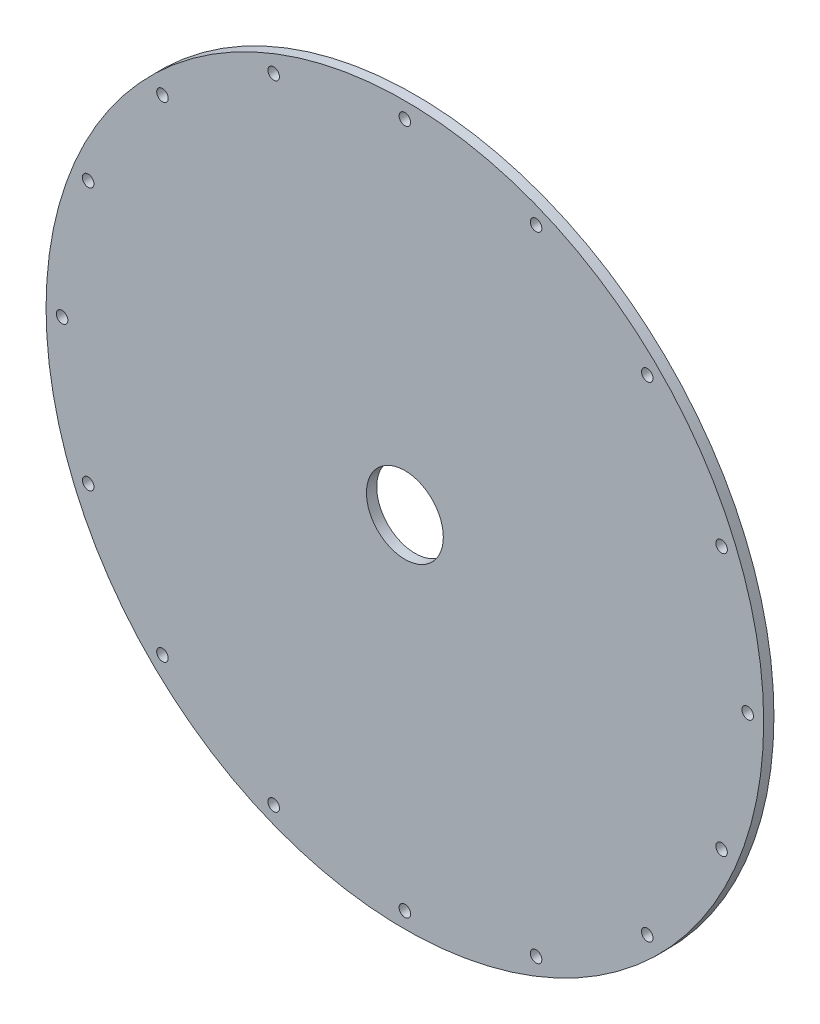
ISO-10303-21;
HEADER;
FILE_DESCRIPTION(('STEP AP214'),'2;1');
FILE_NAME('part.step','',(''),(''),'','','');
FILE_SCHEMA(('AUTOMOTIVE_DESIGN { 1 0 10303 214 1 1 1 1 }'));
ENDSEC;
DATA;
#1=APPLICATION_CONTEXT('core data for automotive mechanical design processes');
#2=APPLICATION_PROTOCOL_DEFINITION('international standard','automotive_design',2000,#1);
#3=PRODUCT_CONTEXT('',#1,'mechanical');
#4=PRODUCT('Part','Part','',(#3));
#5=PRODUCT_RELATED_PRODUCT_CATEGORY('part','',(#4));
#6=PRODUCT_DEFINITION_FORMATION('','',#4);
#7=PRODUCT_DEFINITION_CONTEXT('part definition',#1,'design');
#8=PRODUCT_DEFINITION('design','',#6,#7);
#9=PRODUCT_DEFINITION_SHAPE('','',#8);
#10=(LENGTH_UNIT() NAMED_UNIT(*) SI_UNIT(.MILLI.,.METRE.));
#11=(NAMED_UNIT(*) PLANE_ANGLE_UNIT() SI_UNIT($,.RADIAN.));
#12=(NAMED_UNIT(*) SI_UNIT($,.STERADIAN.) SOLID_ANGLE_UNIT());
#13=UNCERTAINTY_MEASURE_WITH_UNIT(LENGTH_MEASURE(1.E-05),#10,'distance_accuracy_value','');
#14=(GEOMETRIC_REPRESENTATION_CONTEXT(3) GLOBAL_UNCERTAINTY_ASSIGNED_CONTEXT((#13)) GLOBAL_UNIT_ASSIGNED_CONTEXT((#10,
#11,#12)) REPRESENTATION_CONTEXT('',''));
#15=CARTESIAN_POINT('',(0.,0.,0.));
#16=DIRECTION('',(0.,0.,1.));
#17=DIRECTION('',(1.,0.,0.));
#18=AXIS2_PLACEMENT_3D('',#15,#16,#17);
#19=CARTESIAN_POINT('',(0.,0.,8.));
#20=DIRECTION('',(0.,0.,1.));
#21=DIRECTION('',(1.,0.,0.));
#22=AXIS2_PLACEMENT_3D('',#19,#20,#21);
#23=PLANE('',#22);
#24=CARTESIAN_POINT('',(102.367818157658,247.137774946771,8.));
#25=DIRECTION('',(0.,0.,1.));
#26=DIRECTION('',(1.,0.,0.));
#27=AXIS2_PLACEMENT_3D('',#24,#25,#26);
#28=CIRCLE('',#27,4.50000000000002);
#29=CARTESIAN_POINT('',(106.867818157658,247.137774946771,8.));
#30=VERTEX_POINT('',#29);
#31=EDGE_CURVE('E140',#30,#30,#28,.T.);
#32=ORIENTED_EDGE('',*,*,#31,.F.);
#33=EDGE_LOOP('',(#32));
#34=FACE_BOUND('',#33,.T.);
#35=CARTESIAN_POINT('',(189.151063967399,189.151063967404,8.));
#36=DIRECTION('',(0.,0.,1.));
#37=DIRECTION('',(1.,0.,0.));
#38=AXIS2_PLACEMENT_3D('',#35,#36,#37);
#39=CIRCLE('',#38,4.5);
#40=CARTESIAN_POINT('',(193.651063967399,189.151063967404,8.));
#41=VERTEX_POINT('',#40);
#42=EDGE_CURVE('E134',#41,#41,#39,.T.);
#43=ORIENTED_EDGE('',*,*,#42,.F.);
#44=EDGE_LOOP('',(#43));
#45=FACE_BOUND('',#44,.T.);
#46=CARTESIAN_POINT('',(247.137774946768,102.367818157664,8.));
#47=DIRECTION('',(0.,0.,1.));
#48=DIRECTION('',(1.,0.,0.));
#49=AXIS2_PLACEMENT_3D('',#46,#47,#48);
#50=CIRCLE('',#49,4.50000000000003);
#51=CARTESIAN_POINT('',(251.637774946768,102.367818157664,8.));
#52=VERTEX_POINT('',#51);
#53=EDGE_CURVE('E128',#52,#52,#50,.T.);
#54=ORIENTED_EDGE('',*,*,#53,.F.);
#55=EDGE_LOOP('',(#54));
#56=FACE_BOUND('',#55,.T.);
#57=CARTESIAN_POINT('',(267.5,2.80191539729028E-12,8.));
#58=DIRECTION('',(0.,0.,1.));
#59=DIRECTION('',(1.,0.,0.));
#60=AXIS2_PLACEMENT_3D('',#57,#58,#59);
#61=CIRCLE('',#60,4.5);
#62=CARTESIAN_POINT('',(272.,2.80191539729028E-12,8.));
#63=VERTEX_POINT('',#62);
#64=EDGE_CURVE('E122',#63,#63,#61,.T.);
#65=ORIENTED_EDGE('',*,*,#64,.F.);
#66=EDGE_LOOP('',(#65));
#67=FACE_BOUND('',#66,.T.);
#68=CARTESIAN_POINT('',(247.13777494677,-102.367818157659,8.));
#69=DIRECTION('',(0.,0.,1.));
#70=DIRECTION('',(1.,0.,0.));
#71=AXIS2_PLACEMENT_3D('',#68,#69,#70);
#72=CIRCLE('',#71,4.5);
#73=CARTESIAN_POINT('',(251.63777494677,-102.367818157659,8.));
#74=VERTEX_POINT('',#73);
#75=EDGE_CURVE('E116',#74,#74,#72,.T.);
#76=ORIENTED_EDGE('',*,*,#75,.F.);
#77=EDGE_LOOP('',(#76));
#78=FACE_BOUND('',#77,.T.);
#79=CARTESIAN_POINT('',(189.151063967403,-189.1510639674,8.));
#80=DIRECTION('',(0.,0.,1.));
#81=DIRECTION('',(1.,0.,0.));
#82=AXIS2_PLACEMENT_3D('',#79,#80,#81);
#83=CIRCLE('',#82,4.5);
#84=CARTESIAN_POINT('',(193.651063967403,-189.1510639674,8.));
#85=VERTEX_POINT('',#84);
#86=EDGE_CURVE('E110',#85,#85,#83,.T.);
#87=ORIENTED_EDGE('',*,*,#86,.F.);
#88=EDGE_LOOP('',(#87));
#89=FACE_BOUND('',#88,.T.);
#90=CARTESIAN_POINT('',(102.367818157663,-247.137774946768,8.));
#91=DIRECTION('',(0.,0.,1.));
#92=DIRECTION('',(1.,0.,0.));
#93=AXIS2_PLACEMENT_3D('',#90,#91,#92);
#94=CIRCLE('',#93,4.50000000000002);
#95=CARTESIAN_POINT('',(106.867818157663,-247.137774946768,8.));
#96=VERTEX_POINT('',#95);
#97=EDGE_CURVE('E104',#96,#96,#94,.T.);
#98=ORIENTED_EDGE('',*,*,#97,.F.);
#99=EDGE_LOOP('',(#98));
#100=FACE_BOUND('',#99,.T.);
#101=CARTESIAN_POINT('',(1.86794359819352E-12,-267.5,8.));
#102=DIRECTION('',(0.,0.,1.));
#103=DIRECTION('',(1.,0.,0.));
#104=AXIS2_PLACEMENT_3D('',#101,#102,#103);
#105=CIRCLE('',#104,4.50000000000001);
#106=CARTESIAN_POINT('',(4.50000000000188,-267.5,8.));
#107=VERTEX_POINT('',#106);
#108=EDGE_CURVE('E98',#107,#107,#105,.T.);
#109=ORIENTED_EDGE('',*,*,#108,.F.);
#110=EDGE_LOOP('',(#109));
#111=FACE_BOUND('',#110,.T.);
#112=CARTESIAN_POINT('',(-102.36781815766,-247.13777494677,8.));
#113=DIRECTION('',(0.,0.,1.));
#114=DIRECTION('',(1.,0.,0.));
#115=AXIS2_PLACEMENT_3D('',#112,#113,#114);
#116=CIRCLE('',#115,4.50000000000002);
#117=CARTESIAN_POINT('',(-97.86781815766,-247.13777494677,8.));
#118=VERTEX_POINT('',#117);
#119=EDGE_CURVE('E92',#118,#118,#116,.T.);
#120=ORIENTED_EDGE('',*,*,#119,.F.);
#121=EDGE_LOOP('',(#120));
#122=FACE_BOUND('',#121,.T.);
#123=CARTESIAN_POINT('',(-189.1510639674,-189.151063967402,8.));
#124=DIRECTION('',(0.,0.,1.));
#125=DIRECTION('',(1.,0.,0.));
#126=AXIS2_PLACEMENT_3D('',#123,#124,#125);
#127=CIRCLE('',#126,4.5);
#128=CARTESIAN_POINT('',(-184.6510639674,-189.151063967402,8.));
#129=VERTEX_POINT('',#128);
#130=EDGE_CURVE('E86',#129,#129,#127,.T.);
#131=ORIENTED_EDGE('',*,*,#130,.F.);
#132=EDGE_LOOP('',(#131));
#133=FACE_BOUND('',#132,.T.);
#134=CARTESIAN_POINT('',(-247.137774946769,-102.367818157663,8.));
#135=DIRECTION('',(0.,0.,1.));
#136=DIRECTION('',(1.,0.,0.));
#137=AXIS2_PLACEMENT_3D('',#134,#135,#136);
#138=CIRCLE('',#137,4.5);
#139=CARTESIAN_POINT('',(-242.637774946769,-102.367818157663,8.));
#140=VERTEX_POINT('',#139);
#141=EDGE_CURVE('E80',#140,#140,#138,.T.);
#142=ORIENTED_EDGE('',*,*,#141,.F.);
#143=EDGE_LOOP('',(#142));
#144=FACE_BOUND('',#143,.T.);
#145=CARTESIAN_POINT('',(-267.5,-9.3397179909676E-13,8.));
#146=DIRECTION('',(0.,0.,1.));
#147=DIRECTION('',(1.,0.,0.));
#148=AXIS2_PLACEMENT_3D('',#145,#146,#147);
#149=CIRCLE('',#148,4.5);
#150=CARTESIAN_POINT('',(-263.,-9.3397179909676E-13,8.));
#151=VERTEX_POINT('',#150);
#152=EDGE_CURVE('E74',#151,#151,#149,.T.);
#153=ORIENTED_EDGE('',*,*,#152,.F.);
#154=EDGE_LOOP('',(#153));
#155=FACE_BOUND('',#154,.T.);
#156=CARTESIAN_POINT('',(-247.137774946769,102.367818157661,8.));
#157=DIRECTION('',(0.,0.,1.));
#158=DIRECTION('',(1.,0.,0.));
#159=AXIS2_PLACEMENT_3D('',#156,#157,#158);
#160=CIRCLE('',#159,4.5);
#161=CARTESIAN_POINT('',(-242.637774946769,102.367818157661,8.));
#162=VERTEX_POINT('',#161);
#163=EDGE_CURVE('E68',#162,#162,#160,.T.);
#164=ORIENTED_EDGE('',*,*,#163,.F.);
#165=EDGE_LOOP('',(#164));
#166=FACE_BOUND('',#165,.T.);
#167=CARTESIAN_POINT('',(-189.151063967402,189.151063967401,8.));
#168=DIRECTION('',(0.,0.,1.));
#169=DIRECTION('',(1.,0.,0.));
#170=AXIS2_PLACEMENT_3D('',#167,#168,#169);
#171=CIRCLE('',#170,4.5);
#172=CARTESIAN_POINT('',(-184.651063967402,189.151063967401,8.));
#173=VERTEX_POINT('',#172);
#174=EDGE_CURVE('E62',#173,#173,#171,.T.);
#175=ORIENTED_EDGE('',*,*,#174,.F.);
#176=EDGE_LOOP('',(#175));
#177=FACE_BOUND('',#176,.T.);
#178=CARTESIAN_POINT('',(-102.367818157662,247.137774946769,8.));
#179=DIRECTION('',(0.,0.,1.));
#180=DIRECTION('',(1.,0.,0.));
#181=AXIS2_PLACEMENT_3D('',#178,#179,#180);
#182=CIRCLE('',#181,4.50000000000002);
#183=CARTESIAN_POINT('',(-97.8678181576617,247.137774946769,8.));
#184=VERTEX_POINT('',#183);
#185=EDGE_CURVE('E56',#184,#184,#182,.T.);
#186=ORIENTED_EDGE('',*,*,#185,.F.);
#187=EDGE_LOOP('',(#186));
#188=FACE_BOUND('',#187,.T.);
#189=CARTESIAN_POINT('',(0.,267.5,8.));
#190=DIRECTION('',(0.,0.,1.));
#191=DIRECTION('',(1.,0.,0.));
#192=AXIS2_PLACEMENT_3D('',#189,#190,#191);
#193=CIRCLE('',#192,4.50000000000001);
#194=CARTESIAN_POINT('',(4.50000000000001,267.5,8.));
#195=VERTEX_POINT('',#194);
#196=EDGE_CURVE('E50',#195,#195,#193,.T.);
#197=ORIENTED_EDGE('',*,*,#196,.F.);
#198=EDGE_LOOP('',(#197));
#199=FACE_BOUND('',#198,.T.);
#200=CARTESIAN_POINT('',(0.,0.,8.));
#201=DIRECTION('',(0.,0.,1.));
#202=DIRECTION('',(1.,0.,0.));
#203=AXIS2_PLACEMENT_3D('',#200,#201,#202);
#204=CIRCLE('',#203,280.);
#205=CARTESIAN_POINT('',(280.,0.,8.));
#206=VERTEX_POINT('',#205);
#207=EDGE_CURVE('E10',#206,#206,#204,.T.);
#208=ORIENTED_EDGE('',*,*,#207,.T.);
#209=EDGE_LOOP('',(#208));
#210=FACE_BOUND('',#209,.T.);
#211=CARTESIAN_POINT('',(0.,0.,8.));
#212=DIRECTION('',(0.,0.,1.));
#213=DIRECTION('',(1.,0.,0.));
#214=AXIS2_PLACEMENT_3D('',#211,#212,#213);
#215=CIRCLE('',#214,30.);
#216=CARTESIAN_POINT('',(30.,0.,8.));
#217=VERTEX_POINT('',#216);
#218=EDGE_CURVE('E40',#217,#217,#215,.T.);
#219=ORIENTED_EDGE('',*,*,#218,.F.);
#220=EDGE_LOOP('',(#219));
#221=FACE_BOUND('',#220,.T.);
#222=ADVANCED_FACE('F29',(#34,#45,#56,#67,#78,#89,#100,#111,#122,#133,#144,#155,#166,#177,#188,
#199,#210,#221),#23,.T.);
#223=CARTESIAN_POINT('',(0.,0.,0.));
#224=DIRECTION('',(0.,0.,1.));
#225=DIRECTION('',(1.,0.,0.));
#226=AXIS2_PLACEMENT_3D('',#223,#224,#225);
#227=PLANE('',#226);
#228=CARTESIAN_POINT('',(102.367818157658,247.137774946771,0.));
#229=DIRECTION('',(0.,0.,1.));
#230=DIRECTION('',(1.,0.,0.));
#231=AXIS2_PLACEMENT_3D('',#228,#229,#230);
#232=CIRCLE('',#231,4.50000000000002);
#233=CARTESIAN_POINT('',(106.867818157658,247.137774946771,0.));
#234=VERTEX_POINT('',#233);
#235=EDGE_CURVE('E137',#234,#234,#232,.T.);
#236=ORIENTED_EDGE('',*,*,#235,.T.);
#237=EDGE_LOOP('',(#236));
#238=FACE_BOUND('',#237,.T.);
#239=CARTESIAN_POINT('',(189.151063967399,189.151063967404,0.));
#240=DIRECTION('',(0.,0.,1.));
#241=DIRECTION('',(1.,0.,0.));
#242=AXIS2_PLACEMENT_3D('',#239,#240,#241);
#243=CIRCLE('',#242,4.5);
#244=CARTESIAN_POINT('',(193.651063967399,189.151063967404,0.));
#245=VERTEX_POINT('',#244);
#246=EDGE_CURVE('E131',#245,#245,#243,.T.);
#247=ORIENTED_EDGE('',*,*,#246,.T.);
#248=EDGE_LOOP('',(#247));
#249=FACE_BOUND('',#248,.T.);
#250=CARTESIAN_POINT('',(247.137774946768,102.367818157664,0.));
#251=DIRECTION('',(0.,0.,1.));
#252=DIRECTION('',(1.,0.,0.));
#253=AXIS2_PLACEMENT_3D('',#250,#251,#252);
#254=CIRCLE('',#253,4.50000000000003);
#255=CARTESIAN_POINT('',(251.637774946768,102.367818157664,0.));
#256=VERTEX_POINT('',#255);
#257=EDGE_CURVE('E125',#256,#256,#254,.T.);
#258=ORIENTED_EDGE('',*,*,#257,.T.);
#259=EDGE_LOOP('',(#258));
#260=FACE_BOUND('',#259,.T.);
#261=CARTESIAN_POINT('',(267.5,2.80191539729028E-12,0.));
#262=DIRECTION('',(0.,0.,1.));
#263=DIRECTION('',(1.,0.,0.));
#264=AXIS2_PLACEMENT_3D('',#261,#262,#263);
#265=CIRCLE('',#264,4.5);
#266=CARTESIAN_POINT('',(272.,2.80191539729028E-12,0.));
#267=VERTEX_POINT('',#266);
#268=EDGE_CURVE('E119',#267,#267,#265,.T.);
#269=ORIENTED_EDGE('',*,*,#268,.T.);
#270=EDGE_LOOP('',(#269));
#271=FACE_BOUND('',#270,.T.);
#272=CARTESIAN_POINT('',(247.13777494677,-102.367818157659,0.));
#273=DIRECTION('',(0.,0.,1.));
#274=DIRECTION('',(1.,0.,0.));
#275=AXIS2_PLACEMENT_3D('',#272,#273,#274);
#276=CIRCLE('',#275,4.5);
#277=CARTESIAN_POINT('',(251.63777494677,-102.367818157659,0.));
#278=VERTEX_POINT('',#277);
#279=EDGE_CURVE('E113',#278,#278,#276,.T.);
#280=ORIENTED_EDGE('',*,*,#279,.T.);
#281=EDGE_LOOP('',(#280));
#282=FACE_BOUND('',#281,.T.);
#283=CARTESIAN_POINT('',(189.151063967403,-189.1510639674,0.));
#284=DIRECTION('',(0.,0.,1.));
#285=DIRECTION('',(1.,0.,0.));
#286=AXIS2_PLACEMENT_3D('',#283,#284,#285);
#287=CIRCLE('',#286,4.5);
#288=CARTESIAN_POINT('',(193.651063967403,-189.1510639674,0.));
#289=VERTEX_POINT('',#288);
#290=EDGE_CURVE('E107',#289,#289,#287,.T.);
#291=ORIENTED_EDGE('',*,*,#290,.T.);
#292=EDGE_LOOP('',(#291));
#293=FACE_BOUND('',#292,.T.);
#294=CARTESIAN_POINT('',(102.367818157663,-247.137774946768,0.));
#295=DIRECTION('',(0.,0.,1.));
#296=DIRECTION('',(1.,0.,0.));
#297=AXIS2_PLACEMENT_3D('',#294,#295,#296);
#298=CIRCLE('',#297,4.50000000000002);
#299=CARTESIAN_POINT('',(106.867818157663,-247.137774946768,0.));
#300=VERTEX_POINT('',#299);
#301=EDGE_CURVE('E101',#300,#300,#298,.T.);
#302=ORIENTED_EDGE('',*,*,#301,.T.);
#303=EDGE_LOOP('',(#302));
#304=FACE_BOUND('',#303,.T.);
#305=CARTESIAN_POINT('',(1.86794359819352E-12,-267.5,0.));
#306=DIRECTION('',(0.,0.,1.));
#307=DIRECTION('',(1.,0.,0.));
#308=AXIS2_PLACEMENT_3D('',#305,#306,#307);
#309=CIRCLE('',#308,4.50000000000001);
#310=CARTESIAN_POINT('',(4.50000000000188,-267.5,0.));
#311=VERTEX_POINT('',#310);
#312=EDGE_CURVE('E95',#311,#311,#309,.T.);
#313=ORIENTED_EDGE('',*,*,#312,.T.);
#314=EDGE_LOOP('',(#313));
#315=FACE_BOUND('',#314,.T.);
#316=CARTESIAN_POINT('',(-102.36781815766,-247.13777494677,0.));
#317=DIRECTION('',(0.,0.,1.));
#318=DIRECTION('',(1.,0.,0.));
#319=AXIS2_PLACEMENT_3D('',#316,#317,#318);
#320=CIRCLE('',#319,4.50000000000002);
#321=CARTESIAN_POINT('',(-97.86781815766,-247.13777494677,0.));
#322=VERTEX_POINT('',#321);
#323=EDGE_CURVE('E89',#322,#322,#320,.T.);
#324=ORIENTED_EDGE('',*,*,#323,.T.);
#325=EDGE_LOOP('',(#324));
#326=FACE_BOUND('',#325,.T.);
#327=CARTESIAN_POINT('',(-189.1510639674,-189.151063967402,0.));
#328=DIRECTION('',(0.,0.,1.));
#329=DIRECTION('',(1.,0.,0.));
#330=AXIS2_PLACEMENT_3D('',#327,#328,#329);
#331=CIRCLE('',#330,4.5);
#332=CARTESIAN_POINT('',(-184.6510639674,-189.151063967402,0.));
#333=VERTEX_POINT('',#332);
#334=EDGE_CURVE('E83',#333,#333,#331,.T.);
#335=ORIENTED_EDGE('',*,*,#334,.T.);
#336=EDGE_LOOP('',(#335));
#337=FACE_BOUND('',#336,.T.);
#338=CARTESIAN_POINT('',(-247.137774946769,-102.367818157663,0.));
#339=DIRECTION('',(0.,0.,1.));
#340=DIRECTION('',(1.,0.,0.));
#341=AXIS2_PLACEMENT_3D('',#338,#339,#340);
#342=CIRCLE('',#341,4.5);
#343=CARTESIAN_POINT('',(-242.637774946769,-102.367818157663,0.));
#344=VERTEX_POINT('',#343);
#345=EDGE_CURVE('E77',#344,#344,#342,.T.);
#346=ORIENTED_EDGE('',*,*,#345,.T.);
#347=EDGE_LOOP('',(#346));
#348=FACE_BOUND('',#347,.T.);
#349=CARTESIAN_POINT('',(-267.5,-9.3397179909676E-13,0.));
#350=DIRECTION('',(0.,0.,1.));
#351=DIRECTION('',(1.,0.,0.));
#352=AXIS2_PLACEMENT_3D('',#349,#350,#351);
#353=CIRCLE('',#352,4.5);
#354=CARTESIAN_POINT('',(-263.,-9.3397179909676E-13,0.));
#355=VERTEX_POINT('',#354);
#356=EDGE_CURVE('E71',#355,#355,#353,.T.);
#357=ORIENTED_EDGE('',*,*,#356,.T.);
#358=EDGE_LOOP('',(#357));
#359=FACE_BOUND('',#358,.T.);
#360=CARTESIAN_POINT('',(-247.137774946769,102.367818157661,0.));
#361=DIRECTION('',(0.,0.,1.));
#362=DIRECTION('',(1.,0.,0.));
#363=AXIS2_PLACEMENT_3D('',#360,#361,#362);
#364=CIRCLE('',#363,4.5);
#365=CARTESIAN_POINT('',(-242.637774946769,102.367818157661,0.));
#366=VERTEX_POINT('',#365);
#367=EDGE_CURVE('E65',#366,#366,#364,.T.);
#368=ORIENTED_EDGE('',*,*,#367,.T.);
#369=EDGE_LOOP('',(#368));
#370=FACE_BOUND('',#369,.T.);
#371=CARTESIAN_POINT('',(-189.151063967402,189.151063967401,0.));
#372=DIRECTION('',(0.,0.,1.));
#373=DIRECTION('',(1.,0.,0.));
#374=AXIS2_PLACEMENT_3D('',#371,#372,#373);
#375=CIRCLE('',#374,4.5);
#376=CARTESIAN_POINT('',(-184.651063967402,189.151063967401,0.));
#377=VERTEX_POINT('',#376);
#378=EDGE_CURVE('E59',#377,#377,#375,.T.);
#379=ORIENTED_EDGE('',*,*,#378,.T.);
#380=EDGE_LOOP('',(#379));
#381=FACE_BOUND('',#380,.T.);
#382=CARTESIAN_POINT('',(-102.367818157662,247.137774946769,0.));
#383=DIRECTION('',(0.,0.,1.));
#384=DIRECTION('',(1.,0.,0.));
#385=AXIS2_PLACEMENT_3D('',#382,#383,#384);
#386=CIRCLE('',#385,4.50000000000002);
#387=CARTESIAN_POINT('',(-97.8678181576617,247.137774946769,0.));
#388=VERTEX_POINT('',#387);
#389=EDGE_CURVE('E53',#388,#388,#386,.T.);
#390=ORIENTED_EDGE('',*,*,#389,.T.);
#391=EDGE_LOOP('',(#390));
#392=FACE_BOUND('',#391,.T.);
#393=CARTESIAN_POINT('',(0.,267.5,0.));
#394=DIRECTION('',(0.,0.,1.));
#395=DIRECTION('',(1.,0.,0.));
#396=AXIS2_PLACEMENT_3D('',#393,#394,#395);
#397=CIRCLE('',#396,4.50000000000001);
#398=CARTESIAN_POINT('',(4.50000000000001,267.5,0.));
#399=VERTEX_POINT('',#398);
#400=EDGE_CURVE('E45',#399,#399,#397,.T.);
#401=ORIENTED_EDGE('',*,*,#400,.T.);
#402=EDGE_LOOP('',(#401));
#403=FACE_BOUND('',#402,.T.);
#404=CARTESIAN_POINT('',(0.,0.,0.));
#405=DIRECTION('',(0.,0.,1.));
#406=DIRECTION('',(1.,0.,0.));
#407=AXIS2_PLACEMENT_3D('',#404,#405,#406);
#408=CIRCLE('',#407,280.);
#409=CARTESIAN_POINT('',(280.,0.,0.));
#410=VERTEX_POINT('',#409);
#411=EDGE_CURVE('E33',#410,#410,#408,.T.);
#412=ORIENTED_EDGE('',*,*,#411,.F.);
#413=EDGE_LOOP('',(#412));
#414=FACE_BOUND('',#413,.T.);
#415=CARTESIAN_POINT('',(0.,0.,0.));
#416=DIRECTION('',(0.,0.,1.));
#417=DIRECTION('',(1.,0.,0.));
#418=AXIS2_PLACEMENT_3D('',#415,#416,#417);
#419=CIRCLE('',#418,30.);
#420=CARTESIAN_POINT('',(30.,0.,0.));
#421=VERTEX_POINT('',#420);
#422=EDGE_CURVE('E42',#421,#421,#419,.T.);
#423=ORIENTED_EDGE('',*,*,#422,.T.);
#424=EDGE_LOOP('',(#423));
#425=FACE_BOUND('',#424,.T.);
#426=ADVANCED_FACE('F148',(#238,#249,#260,#271,#282,#293,#304,#315,#326,#337,#348,#359,#370,
#381,#392,#403,#414,#425),#227,.F.);
#427=CARTESIAN_POINT('',(0.,0.,8.));
#428=DIRECTION('',(0.,0.,-1.));
#429=DIRECTION('',(-1.,0.,0.));
#430=AXIS2_PLACEMENT_3D('',#427,#428,#429);
#431=CYLINDRICAL_SURFACE('',#430,280.);
#432=ORIENTED_EDGE('',*,*,#207,.F.);
#433=EDGE_LOOP('',(#432));
#434=FACE_BOUND('',#433,.T.);
#435=ORIENTED_EDGE('',*,*,#411,.T.);
#436=EDGE_LOOP('',(#435));
#437=FACE_BOUND('',#436,.T.);
#438=ADVANCED_FACE('F31',(#434,#437),#431,.T.);
#439=CARTESIAN_POINT('',(0.,0.,8.));
#440=DIRECTION('',(0.,0.,-1.));
#441=DIRECTION('',(-1.,0.,0.));
#442=AXIS2_PLACEMENT_3D('',#439,#440,#441);
#443=CYLINDRICAL_SURFACE('',#442,30.);
#444=ORIENTED_EDGE('',*,*,#218,.T.);
#445=EDGE_LOOP('',(#444));
#446=FACE_BOUND('',#445,.T.);
#447=ORIENTED_EDGE('',*,*,#422,.F.);
#448=EDGE_LOOP('',(#447));
#449=FACE_BOUND('',#448,.T.);
#450=ADVANCED_FACE('F182',(#446,#449),#443,.F.);
#451=CARTESIAN_POINT('',(0.,267.5,8.));
#452=DIRECTION('',(0.,0.,1.));
#453=DIRECTION('',(1.,0.,0.));
#454=AXIS2_PLACEMENT_3D('',#451,#452,#453);
#455=CYLINDRICAL_SURFACE('',#454,4.50000000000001);
#456=ORIENTED_EDGE('',*,*,#400,.F.);
#457=EDGE_LOOP('',(#456));
#458=FACE_BOUND('',#457,.T.);
#459=ORIENTED_EDGE('',*,*,#196,.T.);
#460=EDGE_LOOP('',(#459));
#461=FACE_BOUND('',#460,.T.);
#462=ADVANCED_FACE('F185',(#458,#461),#455,.F.);
#463=CARTESIAN_POINT('',(-102.367818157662,247.137774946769,8.));
#464=DIRECTION('',(0.,0.,1.));
#465=DIRECTION('',(1.,0.,0.));
#466=AXIS2_PLACEMENT_3D('',#463,#464,#465);
#467=CYLINDRICAL_SURFACE('',#466,4.50000000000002);
#468=ORIENTED_EDGE('',*,*,#389,.F.);
#469=EDGE_LOOP('',(#468));
#470=FACE_BOUND('',#469,.T.);
#471=ORIENTED_EDGE('',*,*,#185,.T.);
#472=EDGE_LOOP('',(#471));
#473=FACE_BOUND('',#472,.T.);
#474=ADVANCED_FACE('F199',(#470,#473),#467,.F.);
#475=CARTESIAN_POINT('',(-189.151063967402,189.151063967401,8.));
#476=DIRECTION('',(0.,0.,1.));
#477=DIRECTION('',(1.,0.,0.));
#478=AXIS2_PLACEMENT_3D('',#475,#476,#477);
#479=CYLINDRICAL_SURFACE('',#478,4.5);
#480=ORIENTED_EDGE('',*,*,#378,.F.);
#481=EDGE_LOOP('',(#480));
#482=FACE_BOUND('',#481,.T.);
#483=ORIENTED_EDGE('',*,*,#174,.T.);
#484=EDGE_LOOP('',(#483));
#485=FACE_BOUND('',#484,.T.);
#486=ADVANCED_FACE('F203',(#482,#485),#479,.F.);
#487=CARTESIAN_POINT('',(-247.137774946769,102.367818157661,8.));
#488=DIRECTION('',(0.,0.,1.));
#489=DIRECTION('',(1.,0.,0.));
#490=AXIS2_PLACEMENT_3D('',#487,#488,#489);
#491=CYLINDRICAL_SURFACE('',#490,4.5);
#492=ORIENTED_EDGE('',*,*,#367,.F.);
#493=EDGE_LOOP('',(#492));
#494=FACE_BOUND('',#493,.T.);
#495=ORIENTED_EDGE('',*,*,#163,.T.);
#496=EDGE_LOOP('',(#495));
#497=FACE_BOUND('',#496,.T.);
#498=ADVANCED_FACE('F207',(#494,#497),#491,.F.);
#499=CARTESIAN_POINT('',(-267.5,-9.3397179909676E-13,8.));
#500=DIRECTION('',(0.,0.,1.));
#501=DIRECTION('',(1.,0.,0.));
#502=AXIS2_PLACEMENT_3D('',#499,#500,#501);
#503=CYLINDRICAL_SURFACE('',#502,4.5);
#504=ORIENTED_EDGE('',*,*,#356,.F.);
#505=EDGE_LOOP('',(#504));
#506=FACE_BOUND('',#505,.T.);
#507=ORIENTED_EDGE('',*,*,#152,.T.);
#508=EDGE_LOOP('',(#507));
#509=FACE_BOUND('',#508,.T.);
#510=ADVANCED_FACE('F211',(#506,#509),#503,.F.);
#511=CARTESIAN_POINT('',(-247.137774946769,-102.367818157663,8.));
#512=DIRECTION('',(0.,0.,1.));
#513=DIRECTION('',(1.,0.,0.));
#514=AXIS2_PLACEMENT_3D('',#511,#512,#513);
#515=CYLINDRICAL_SURFACE('',#514,4.5);
#516=ORIENTED_EDGE('',*,*,#345,.F.);
#517=EDGE_LOOP('',(#516));
#518=FACE_BOUND('',#517,.T.);
#519=ORIENTED_EDGE('',*,*,#141,.T.);
#520=EDGE_LOOP('',(#519));
#521=FACE_BOUND('',#520,.T.);
#522=ADVANCED_FACE('F215',(#518,#521),#515,.F.);
#523=CARTESIAN_POINT('',(-189.1510639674,-189.151063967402,8.));
#524=DIRECTION('',(0.,0.,1.));
#525=DIRECTION('',(1.,0.,0.));
#526=AXIS2_PLACEMENT_3D('',#523,#524,#525);
#527=CYLINDRICAL_SURFACE('',#526,4.5);
#528=ORIENTED_EDGE('',*,*,#334,.F.);
#529=EDGE_LOOP('',(#528));
#530=FACE_BOUND('',#529,.T.);
#531=ORIENTED_EDGE('',*,*,#130,.T.);
#532=EDGE_LOOP('',(#531));
#533=FACE_BOUND('',#532,.T.);
#534=ADVANCED_FACE('F219',(#530,#533),#527,.F.);
#535=CARTESIAN_POINT('',(-102.36781815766,-247.13777494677,8.));
#536=DIRECTION('',(0.,0.,1.));
#537=DIRECTION('',(1.,0.,0.));
#538=AXIS2_PLACEMENT_3D('',#535,#536,#537);
#539=CYLINDRICAL_SURFACE('',#538,4.50000000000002);
#540=ORIENTED_EDGE('',*,*,#323,.F.);
#541=EDGE_LOOP('',(#540));
#542=FACE_BOUND('',#541,.T.);
#543=ORIENTED_EDGE('',*,*,#119,.T.);
#544=EDGE_LOOP('',(#543));
#545=FACE_BOUND('',#544,.T.);
#546=ADVANCED_FACE('F223',(#542,#545),#539,.F.);
#547=CARTESIAN_POINT('',(1.86794359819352E-12,-267.5,8.));
#548=DIRECTION('',(0.,0.,1.));
#549=DIRECTION('',(1.,0.,0.));
#550=AXIS2_PLACEMENT_3D('',#547,#548,#549);
#551=CYLINDRICAL_SURFACE('',#550,4.50000000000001);
#552=ORIENTED_EDGE('',*,*,#312,.F.);
#553=EDGE_LOOP('',(#552));
#554=FACE_BOUND('',#553,.T.);
#555=ORIENTED_EDGE('',*,*,#108,.T.);
#556=EDGE_LOOP('',(#555));
#557=FACE_BOUND('',#556,.T.);
#558=ADVANCED_FACE('F227',(#554,#557),#551,.F.);
#559=CARTESIAN_POINT('',(102.367818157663,-247.137774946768,8.));
#560=DIRECTION('',(0.,0.,1.));
#561=DIRECTION('',(1.,0.,0.));
#562=AXIS2_PLACEMENT_3D('',#559,#560,#561);
#563=CYLINDRICAL_SURFACE('',#562,4.50000000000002);
#564=ORIENTED_EDGE('',*,*,#301,.F.);
#565=EDGE_LOOP('',(#564));
#566=FACE_BOUND('',#565,.T.);
#567=ORIENTED_EDGE('',*,*,#97,.T.);
#568=EDGE_LOOP('',(#567));
#569=FACE_BOUND('',#568,.T.);
#570=ADVANCED_FACE('F231',(#566,#569),#563,.F.);
#571=CARTESIAN_POINT('',(189.151063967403,-189.1510639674,8.));
#572=DIRECTION('',(0.,0.,1.));
#573=DIRECTION('',(1.,0.,0.));
#574=AXIS2_PLACEMENT_3D('',#571,#572,#573);
#575=CYLINDRICAL_SURFACE('',#574,4.5);
#576=ORIENTED_EDGE('',*,*,#290,.F.);
#577=EDGE_LOOP('',(#576));
#578=FACE_BOUND('',#577,.T.);
#579=ORIENTED_EDGE('',*,*,#86,.T.);
#580=EDGE_LOOP('',(#579));
#581=FACE_BOUND('',#580,.T.);
#582=ADVANCED_FACE('F235',(#578,#581),#575,.F.);
#583=CARTESIAN_POINT('',(247.13777494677,-102.367818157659,8.));
#584=DIRECTION('',(0.,0.,1.));
#585=DIRECTION('',(1.,0.,0.));
#586=AXIS2_PLACEMENT_3D('',#583,#584,#585);
#587=CYLINDRICAL_SURFACE('',#586,4.5);
#588=ORIENTED_EDGE('',*,*,#279,.F.);
#589=EDGE_LOOP('',(#588));
#590=FACE_BOUND('',#589,.T.);
#591=ORIENTED_EDGE('',*,*,#75,.T.);
#592=EDGE_LOOP('',(#591));
#593=FACE_BOUND('',#592,.T.);
#594=ADVANCED_FACE('F239',(#590,#593),#587,.F.);
#595=CARTESIAN_POINT('',(267.5,2.80191539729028E-12,8.));
#596=DIRECTION('',(0.,0.,1.));
#597=DIRECTION('',(1.,0.,0.));
#598=AXIS2_PLACEMENT_3D('',#595,#596,#597);
#599=CYLINDRICAL_SURFACE('',#598,4.5);
#600=ORIENTED_EDGE('',*,*,#268,.F.);
#601=EDGE_LOOP('',(#600));
#602=FACE_BOUND('',#601,.T.);
#603=ORIENTED_EDGE('',*,*,#64,.T.);
#604=EDGE_LOOP('',(#603));
#605=FACE_BOUND('',#604,.T.);
#606=ADVANCED_FACE('F243',(#602,#605),#599,.F.);
#607=CARTESIAN_POINT('',(247.137774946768,102.367818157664,8.));
#608=DIRECTION('',(0.,0.,1.));
#609=DIRECTION('',(1.,0.,0.));
#610=AXIS2_PLACEMENT_3D('',#607,#608,#609);
#611=CYLINDRICAL_SURFACE('',#610,4.50000000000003);
#612=ORIENTED_EDGE('',*,*,#257,.F.);
#613=EDGE_LOOP('',(#612));
#614=FACE_BOUND('',#613,.T.);
#615=ORIENTED_EDGE('',*,*,#53,.T.);
#616=EDGE_LOOP('',(#615));
#617=FACE_BOUND('',#616,.T.);
#618=ADVANCED_FACE('F247',(#614,#617),#611,.F.);
#619=CARTESIAN_POINT('',(189.151063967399,189.151063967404,8.));
#620=DIRECTION('',(0.,0.,1.));
#621=DIRECTION('',(1.,0.,0.));
#622=AXIS2_PLACEMENT_3D('',#619,#620,#621);
#623=CYLINDRICAL_SURFACE('',#622,4.5);
#624=ORIENTED_EDGE('',*,*,#246,.F.);
#625=EDGE_LOOP('',(#624));
#626=FACE_BOUND('',#625,.T.);
#627=ORIENTED_EDGE('',*,*,#42,.T.);
#628=EDGE_LOOP('',(#627));
#629=FACE_BOUND('',#628,.T.);
#630=ADVANCED_FACE('F251',(#626,#629),#623,.F.);
#631=CARTESIAN_POINT('',(102.367818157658,247.137774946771,8.));
#632=DIRECTION('',(0.,0.,1.));
#633=DIRECTION('',(1.,0.,0.));
#634=AXIS2_PLACEMENT_3D('',#631,#632,#633);
#635=CYLINDRICAL_SURFACE('',#634,4.50000000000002);
#636=ORIENTED_EDGE('',*,*,#235,.F.);
#637=EDGE_LOOP('',(#636));
#638=FACE_BOUND('',#637,.T.);
#639=ORIENTED_EDGE('',*,*,#31,.T.);
#640=EDGE_LOOP('',(#639));
#641=FACE_BOUND('',#640,.T.);
#642=ADVANCED_FACE('F144',(#638,#641),#635,.F.);
#643=CLOSED_SHELL('',(#222,#426,#438,#450,#462,#474,#486,#498,#510,#522,#534,#546,#558,#570,
#582,#594,#606,#618,#630,#642));
#644=MANIFOLD_SOLID_BREP('B2',#643);
#645=ADVANCED_BREP_SHAPE_REPRESENTATION('',(#18,#644),#14);
#646=SHAPE_DEFINITION_REPRESENTATION(#9,#645);
ENDSEC;
END-ISO-10303-21;
